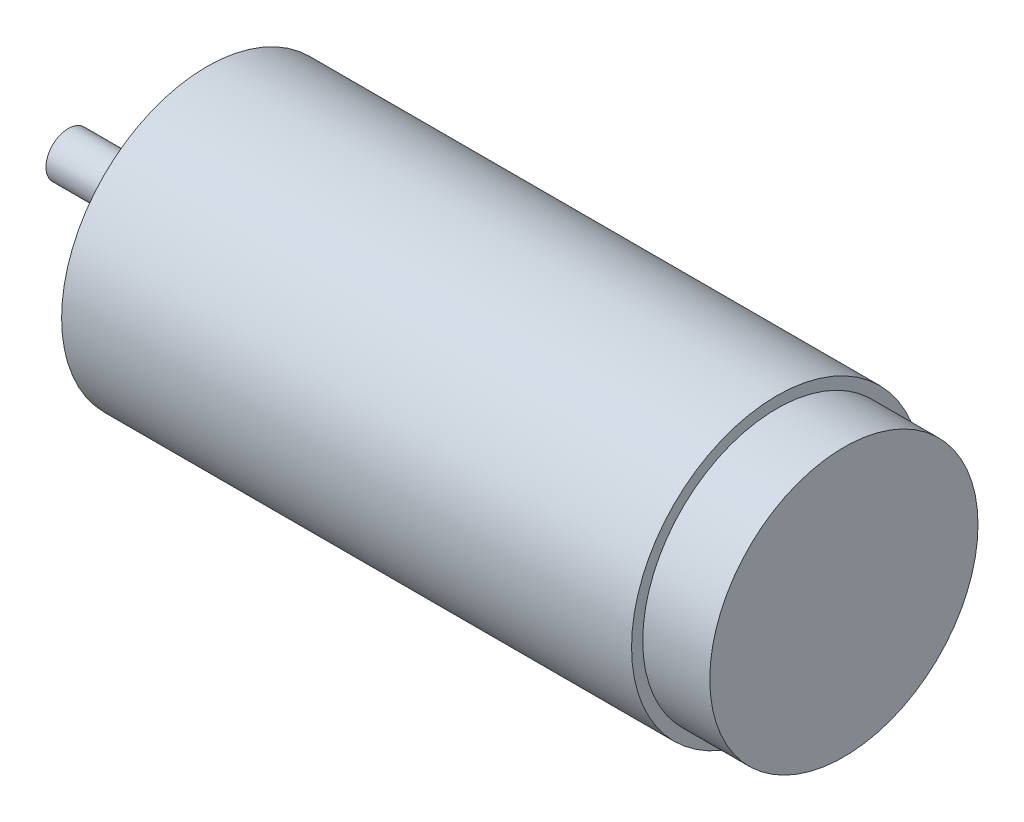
from build123d import *

# Parameters (mm, degrees)
TROU_TARAUD_M3X0_51_D           = 2.5
TROU_TARAUD_M3X0_51_DEPTH       = 5.5
TROU_TARAUD_M3X0_51_CSINK_D     = 3
TROU_TARAUD_M3X0_51_CSINK_ANGLE = 90
TROU_TARAUD_M3X0_51_TIP         = 0.721687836


with BuildPart() as part:
    # Esquisse1 → R_volution1 (revolve)
    with BuildSketch(Plane.XY, mode=Mode.PRIVATE) as r_volution1_sk:
        Polygon((0, 0), (0, 12), (-6, 12), (-6, 13), (-57, 13), (-57, 5), (-58, 5), (-58, 3.25), (-59.4, 3.25), (-59.4, 2), (-69.4, 2), (-69.4, 0), align=None)
    revolve(r_volution1_sk.sketch.rotate(Axis((0, 0, 0), (-1, 0, 0)), 90), axis=Axis((0, 0, 0), (-1, 0, 0)))

    # Trou taraud_ M3x0.51
    with Locations(Plane.ZY.offset(57)):
        with Locations((0, 8.5), (7.361215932, -4.25), (-7.361215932, -4.25)):
            CounterSinkHole(TROU_TARAUD_M3X0_51_D / 2, TROU_TARAUD_M3X0_51_CSINK_D / 2, depth=TROU_TARAUD_M3X0_51_DEPTH, counter_sink_angle=TROU_TARAUD_M3X0_51_CSINK_ANGLE)
            with Locations((0, 0, -(TROU_TARAUD_M3X0_51_DEPTH + TROU_TARAUD_M3X0_51_TIP / 2))):  # 120° drill point
                Cone(0, TROU_TARAUD_M3X0_51_D / 2, TROU_TARAUD_M3X0_51_TIP, mode=Mode.SUBTRACT)


solid = part.part
